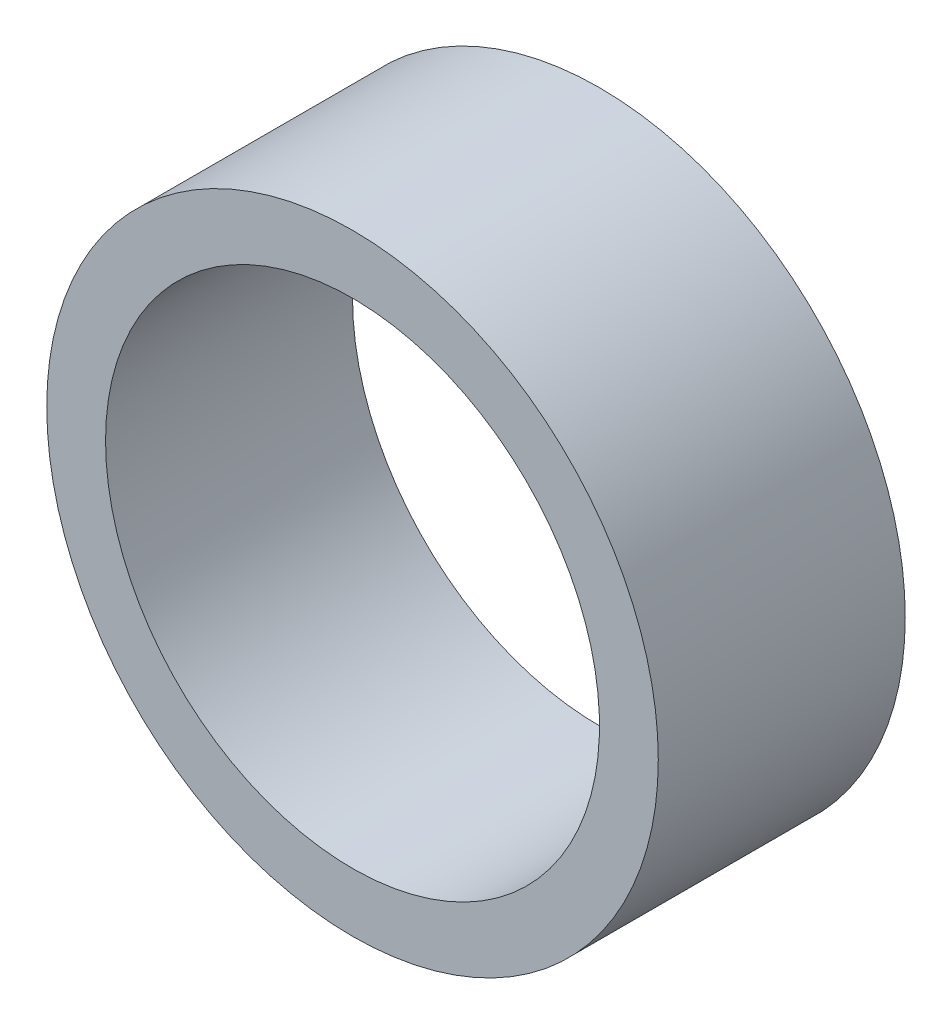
ISO-10303-21;
HEADER;
FILE_DESCRIPTION(('STEP AP214'),'2;1');
FILE_NAME('part.step','',(''),(''),'','','');
FILE_SCHEMA(('AUTOMOTIVE_DESIGN { 1 0 10303 214 1 1 1 1 }'));
ENDSEC;
DATA;
#1=APPLICATION_CONTEXT('core data for automotive mechanical design processes');
#2=APPLICATION_PROTOCOL_DEFINITION('international standard','automotive_design',2000,#1);
#3=PRODUCT_CONTEXT('',#1,'mechanical');
#4=PRODUCT('Part','Part','',(#3));
#5=PRODUCT_RELATED_PRODUCT_CATEGORY('part','',(#4));
#6=PRODUCT_DEFINITION_FORMATION('','',#4);
#7=PRODUCT_DEFINITION_CONTEXT('part definition',#1,'design');
#8=PRODUCT_DEFINITION('design','',#6,#7);
#9=PRODUCT_DEFINITION_SHAPE('','',#8);
#10=(LENGTH_UNIT() NAMED_UNIT(*) SI_UNIT(.MILLI.,.METRE.));
#11=(NAMED_UNIT(*) PLANE_ANGLE_UNIT() SI_UNIT($,.RADIAN.));
#12=(NAMED_UNIT(*) SI_UNIT($,.STERADIAN.) SOLID_ANGLE_UNIT());
#13=UNCERTAINTY_MEASURE_WITH_UNIT(LENGTH_MEASURE(1.E-05),#10,'distance_accuracy_value','');
#14=(GEOMETRIC_REPRESENTATION_CONTEXT(3) GLOBAL_UNCERTAINTY_ASSIGNED_CONTEXT((#13)) GLOBAL_UNIT_ASSIGNED_CONTEXT((#10,
#11,#12)) REPRESENTATION_CONTEXT('',''));
#15=CARTESIAN_POINT('',(0.,0.,0.));
#16=DIRECTION('',(0.,0.,1.));
#17=DIRECTION('',(1.,0.,0.));
#18=AXIS2_PLACEMENT_3D('',#15,#16,#17);
#19=CARTESIAN_POINT('',(0.,0.,21.));
#20=DIRECTION('',(0.,0.,1.));
#21=DIRECTION('',(1.,0.,0.));
#22=AXIS2_PLACEMENT_3D('',#19,#20,#21);
#23=PLANE('',#22);
#24=CARTESIAN_POINT('',(0.,0.,21.));
#25=DIRECTION('',(0.,0.,1.));
#26=DIRECTION('',(1.,0.,0.));
#27=AXIS2_PLACEMENT_3D('',#24,#25,#26);
#28=CIRCLE('',#27,26.);
#29=CARTESIAN_POINT('',(-26.,0.,21.));
#30=VERTEX_POINT('',#29);
#31=EDGE_CURVE('E10',#30,#30,#28,.T.);
#32=ORIENTED_EDGE('',*,*,#31,.T.);
#33=EDGE_LOOP('',(#32));
#34=FACE_BOUND('',#33,.T.);
#35=CARTESIAN_POINT('',(0.,0.,21.));
#36=DIRECTION('',(0.,0.,1.));
#37=DIRECTION('',(1.,0.,0.));
#38=AXIS2_PLACEMENT_3D('',#35,#36,#37);
#39=CIRCLE('',#38,21.);
#40=CARTESIAN_POINT('',(-21.,0.,21.));
#41=VERTEX_POINT('',#40);
#42=EDGE_CURVE('E41',#41,#41,#39,.T.);
#43=ORIENTED_EDGE('',*,*,#42,.F.);
#44=EDGE_LOOP('',(#43));
#45=FACE_BOUND('',#44,.T.);
#46=ADVANCED_FACE('F30',(#34,#45),#23,.T.);
#47=CARTESIAN_POINT('',(0.,0.,0.));
#48=DIRECTION('',(0.,0.,1.));
#49=DIRECTION('',(1.,0.,0.));
#50=AXIS2_PLACEMENT_3D('',#47,#48,#49);
#51=PLANE('',#50);
#52=CARTESIAN_POINT('',(0.,0.,0.));
#53=DIRECTION('',(0.,0.,1.));
#54=DIRECTION('',(1.,0.,0.));
#55=AXIS2_PLACEMENT_3D('',#52,#53,#54);
#56=CIRCLE('',#55,26.);
#57=CARTESIAN_POINT('',(-26.,0.,0.));
#58=VERTEX_POINT('',#57);
#59=EDGE_CURVE('E34',#58,#58,#56,.T.);
#60=ORIENTED_EDGE('',*,*,#59,.F.);
#61=EDGE_LOOP('',(#60));
#62=FACE_BOUND('',#61,.T.);
#63=CARTESIAN_POINT('',(0.,0.,0.));
#64=DIRECTION('',(0.,0.,1.));
#65=DIRECTION('',(1.,0.,0.));
#66=AXIS2_PLACEMENT_3D('',#63,#64,#65);
#67=CIRCLE('',#66,21.);
#68=CARTESIAN_POINT('',(-21.,0.,0.));
#69=VERTEX_POINT('',#68);
#70=EDGE_CURVE('E43',#69,#69,#67,.T.);
#71=ORIENTED_EDGE('',*,*,#70,.T.);
#72=EDGE_LOOP('',(#71));
#73=FACE_BOUND('',#72,.T.);
#74=ADVANCED_FACE('F53',(#62,#73),#51,.F.);
#75=CARTESIAN_POINT('',(0.,0.,21.));
#76=DIRECTION('',(0.,0.,-1.));
#77=DIRECTION('',(-1.,0.,0.));
#78=AXIS2_PLACEMENT_3D('',#75,#76,#77);
#79=CYLINDRICAL_SURFACE('',#78,26.);
#80=CARTESIAN_POINT('',(-26.,0.,21.));
#81=CARTESIAN_POINT('',(-26.,0.,20.78125));
#82=CARTESIAN_POINT('',(-26.,0.,20.5625));
#83=CARTESIAN_POINT('',(-26.,0.,20.125));
#84=CARTESIAN_POINT('',(-26.,0.,19.90625));
#85=CARTESIAN_POINT('',(-26.,0.,19.46875));
#86=CARTESIAN_POINT('',(-26.,0.,19.25));
#87=CARTESIAN_POINT('',(-26.,0.,18.8125));
#88=CARTESIAN_POINT('',(-26.,0.,18.59375));
#89=CARTESIAN_POINT('',(-26.,0.,18.15625));
#90=CARTESIAN_POINT('',(-26.,0.,17.9375));
#91=CARTESIAN_POINT('',(-26.,0.,17.5));
#92=CARTESIAN_POINT('',(-26.,0.,17.28125));
#93=CARTESIAN_POINT('',(-26.,0.,16.84375));
#94=CARTESIAN_POINT('',(-26.,0.,16.625));
#95=CARTESIAN_POINT('',(-26.,0.,16.1875));
#96=CARTESIAN_POINT('',(-26.,0.,15.96875));
#97=CARTESIAN_POINT('',(-26.,0.,15.53125));
#98=CARTESIAN_POINT('',(-26.,0.,15.3125));
#99=CARTESIAN_POINT('',(-26.,0.,14.875));
#100=CARTESIAN_POINT('',(-26.,0.,14.65625));
#101=CARTESIAN_POINT('',(-26.,0.,14.21875));
#102=CARTESIAN_POINT('',(-26.,0.,14.));
#103=CARTESIAN_POINT('',(-26.,0.,13.5625));
#104=CARTESIAN_POINT('',(-26.,0.,13.34375));
#105=CARTESIAN_POINT('',(-26.,0.,12.90625));
#106=CARTESIAN_POINT('',(-26.,0.,12.6875));
#107=CARTESIAN_POINT('',(-26.,0.,12.25));
#108=CARTESIAN_POINT('',(-26.,0.,12.03125));
#109=CARTESIAN_POINT('',(-26.,0.,11.59375));
#110=CARTESIAN_POINT('',(-26.,0.,11.375));
#111=CARTESIAN_POINT('',(-26.,0.,10.9375));
#112=CARTESIAN_POINT('',(-26.,0.,10.71875));
#113=CARTESIAN_POINT('',(-26.,0.,10.28125));
#114=CARTESIAN_POINT('',(-26.,0.,10.0625));
#115=CARTESIAN_POINT('',(-26.,0.,9.625));
#116=CARTESIAN_POINT('',(-26.,0.,9.40625));
#117=CARTESIAN_POINT('',(-26.,0.,8.96875));
#118=CARTESIAN_POINT('',(-26.,0.,8.75));
#119=CARTESIAN_POINT('',(-26.,0.,8.3125));
#120=CARTESIAN_POINT('',(-26.,0.,8.09375));
#121=CARTESIAN_POINT('',(-26.,0.,7.65625));
#122=CARTESIAN_POINT('',(-26.,0.,7.4375));
#123=CARTESIAN_POINT('',(-26.,0.,7.));
#124=CARTESIAN_POINT('',(-26.,0.,6.78125));
#125=CARTESIAN_POINT('',(-26.,0.,6.34375));
#126=CARTESIAN_POINT('',(-26.,0.,6.125));
#127=CARTESIAN_POINT('',(-26.,0.,5.6875));
#128=CARTESIAN_POINT('',(-26.,0.,5.46875));
#129=CARTESIAN_POINT('',(-26.,0.,5.03125));
#130=CARTESIAN_POINT('',(-26.,0.,4.8125));
#131=CARTESIAN_POINT('',(-26.,0.,4.375));
#132=CARTESIAN_POINT('',(-26.,0.,4.15625));
#133=CARTESIAN_POINT('',(-26.,0.,3.71875));
#134=CARTESIAN_POINT('',(-26.,0.,3.5));
#135=CARTESIAN_POINT('',(-26.,0.,3.0625));
#136=CARTESIAN_POINT('',(-26.,0.,2.84375));
#137=CARTESIAN_POINT('',(-26.,0.,2.40625));
#138=CARTESIAN_POINT('',(-26.,0.,2.1875));
#139=CARTESIAN_POINT('',(-26.,0.,1.75));
#140=CARTESIAN_POINT('',(-26.,0.,1.53125));
#141=CARTESIAN_POINT('',(-26.,0.,1.09375));
#142=CARTESIAN_POINT('',(-26.,0.,0.875000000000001));
#143=CARTESIAN_POINT('',(-26.,0.,0.4375));
#144=CARTESIAN_POINT('',(-26.,0.,0.21875));
#145=CARTESIAN_POINT('',(-26.,0.,0.));
#146=B_SPLINE_CURVE_WITH_KNOTS('',3,(#80,#81,#82,#83,#84,#85,#86,#87,#88,#89,#90,#91,#92,#93,
#94,#95,#96,#97,#98,#99,#100,#101,#102,#103,#104,#105,#106,#107,#108,#109,#110,#111,#112,#113,
#114,#115,#116,#117,#118,#119,#120,#121,#122,#123,#124,#125,#126,#127,#128,#129,#130,#131,#132,
#133,#134,#135,#136,#137,#138,#139,#140,#141,#142,#143,#144,#145),.UNSPECIFIED.,.F.,.F.,(4,2,2,
2,2,2,2,2,2,2,2,2,2,2,2,2,2,2,2,2,2,2,2,2,2,2,2,2,2,2,2,2,4),(0.,0.656249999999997,1.3125,
1.96875,2.625,3.28125,3.9375,4.59375,5.25,5.90625,6.5625,7.21875,7.875,8.53125,9.1875,9.84375,
10.5,11.15625,11.8125,12.46875,13.125,13.78125,14.4375,15.09375,15.75,16.40625,17.0625,17.71875,
18.375,19.03125,19.6875,20.34375,21.),.UNSPECIFIED.);
#147=EDGE_CURVE('BSEAM32',#30,#58,#146,.T.);
#148=ORIENTED_EDGE('',*,*,#31,.F.);
#149=ORIENTED_EDGE('',*,*,#59,.T.);
#150=ORIENTED_EDGE('',*,*,#147,.T.);
#151=ORIENTED_EDGE('',*,*,#147,.F.);
#152=EDGE_LOOP('',(#148,#150,#149,#151));
#153=FACE_BOUND('',#152,.T.);
#154=ADVANCED_FACE('F32',(#153),#79,.T.);
#155=CARTESIAN_POINT('',(0.,0.,21.));
#156=DIRECTION('',(0.,0.,-1.));
#157=DIRECTION('',(-1.,0.,0.));
#158=AXIS2_PLACEMENT_3D('',#155,#156,#157);
#159=CYLINDRICAL_SURFACE('',#158,21.);
#160=CARTESIAN_POINT('',(-21.,0.,21.));
#161=CARTESIAN_POINT('',(-21.,0.,20.78125));
#162=CARTESIAN_POINT('',(-21.,0.,20.5625));
#163=CARTESIAN_POINT('',(-21.,0.,20.125));
#164=CARTESIAN_POINT('',(-21.,0.,19.90625));
#165=CARTESIAN_POINT('',(-21.,0.,19.46875));
#166=CARTESIAN_POINT('',(-21.,0.,19.25));
#167=CARTESIAN_POINT('',(-21.,0.,18.8125));
#168=CARTESIAN_POINT('',(-21.,0.,18.59375));
#169=CARTESIAN_POINT('',(-21.,0.,18.15625));
#170=CARTESIAN_POINT('',(-21.,0.,17.9375));
#171=CARTESIAN_POINT('',(-21.,0.,17.5));
#172=CARTESIAN_POINT('',(-21.,0.,17.28125));
#173=CARTESIAN_POINT('',(-21.,0.,16.84375));
#174=CARTESIAN_POINT('',(-21.,0.,16.625));
#175=CARTESIAN_POINT('',(-21.,0.,16.1875));
#176=CARTESIAN_POINT('',(-21.,0.,15.96875));
#177=CARTESIAN_POINT('',(-21.,0.,15.53125));
#178=CARTESIAN_POINT('',(-21.,0.,15.3125));
#179=CARTESIAN_POINT('',(-21.,0.,14.875));
#180=CARTESIAN_POINT('',(-21.,0.,14.65625));
#181=CARTESIAN_POINT('',(-21.,0.,14.21875));
#182=CARTESIAN_POINT('',(-21.,0.,14.));
#183=CARTESIAN_POINT('',(-21.,0.,13.5625));
#184=CARTESIAN_POINT('',(-21.,0.,13.34375));
#185=CARTESIAN_POINT('',(-21.,0.,12.90625));
#186=CARTESIAN_POINT('',(-21.,0.,12.6875));
#187=CARTESIAN_POINT('',(-21.,0.,12.25));
#188=CARTESIAN_POINT('',(-21.,0.,12.03125));
#189=CARTESIAN_POINT('',(-21.,0.,11.59375));
#190=CARTESIAN_POINT('',(-21.,0.,11.375));
#191=CARTESIAN_POINT('',(-21.,0.,10.9375));
#192=CARTESIAN_POINT('',(-21.,0.,10.71875));
#193=CARTESIAN_POINT('',(-21.,0.,10.28125));
#194=CARTESIAN_POINT('',(-21.,0.,10.0625));
#195=CARTESIAN_POINT('',(-21.,0.,9.625));
#196=CARTESIAN_POINT('',(-21.,0.,9.40625));
#197=CARTESIAN_POINT('',(-21.,0.,8.96875));
#198=CARTESIAN_POINT('',(-21.,0.,8.75));
#199=CARTESIAN_POINT('',(-21.,0.,8.3125));
#200=CARTESIAN_POINT('',(-21.,0.,8.09375));
#201=CARTESIAN_POINT('',(-21.,0.,7.65625));
#202=CARTESIAN_POINT('',(-21.,0.,7.4375));
#203=CARTESIAN_POINT('',(-21.,0.,7.));
#204=CARTESIAN_POINT('',(-21.,0.,6.78125));
#205=CARTESIAN_POINT('',(-21.,0.,6.34375));
#206=CARTESIAN_POINT('',(-21.,0.,6.125));
#207=CARTESIAN_POINT('',(-21.,0.,5.6875));
#208=CARTESIAN_POINT('',(-21.,0.,5.46875));
#209=CARTESIAN_POINT('',(-21.,0.,5.03125));
#210=CARTESIAN_POINT('',(-21.,0.,4.8125));
#211=CARTESIAN_POINT('',(-21.,0.,4.375));
#212=CARTESIAN_POINT('',(-21.,0.,4.15625));
#213=CARTESIAN_POINT('',(-21.,0.,3.71875));
#214=CARTESIAN_POINT('',(-21.,0.,3.5));
#215=CARTESIAN_POINT('',(-21.,0.,3.0625));
#216=CARTESIAN_POINT('',(-21.,0.,2.84375));
#217=CARTESIAN_POINT('',(-21.,0.,2.40625));
#218=CARTESIAN_POINT('',(-21.,0.,2.1875));
#219=CARTESIAN_POINT('',(-21.,0.,1.75));
#220=CARTESIAN_POINT('',(-21.,0.,1.53125));
#221=CARTESIAN_POINT('',(-21.,0.,1.09375));
#222=CARTESIAN_POINT('',(-21.,0.,0.875000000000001));
#223=CARTESIAN_POINT('',(-21.,0.,0.4375));
#224=CARTESIAN_POINT('',(-21.,0.,0.21875));
#225=CARTESIAN_POINT('',(-21.,0.,0.));
#226=B_SPLINE_CURVE_WITH_KNOTS('',3,(#160,#161,#162,#163,#164,#165,#166,#167,#168,#169,#170,
#171,#172,#173,#174,#175,#176,#177,#178,#179,#180,#181,#182,#183,#184,#185,#186,#187,#188,#189,
#190,#191,#192,#193,#194,#195,#196,#197,#198,#199,#200,#201,#202,#203,#204,#205,#206,#207,#208,
#209,#210,#211,#212,#213,#214,#215,#216,#217,#218,#219,#220,#221,#222,#223,#224,#225),
.UNSPECIFIED.,.F.,.F.,(4,2,2,2,2,2,2,2,2,2,2,2,2,2,2,2,2,2,2,2,2,2,2,2,2,2,2,2,2,2,2,2,4),(0.,
0.656250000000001,1.3125,1.96875,2.625,3.28125,3.9375,4.59375,5.25,5.90625,6.5625,7.21875,7.875,
8.53125,9.1875,9.84375,10.5,11.15625,11.8125,12.46875,13.125,13.78125,14.4375,15.09375,15.75,
16.40625,17.0625,17.71875,18.375,19.03125,19.6875,20.34375,21.),.UNSPECIFIED.);
#227=EDGE_CURVE('BSEAM49',#41,#69,#226,.T.);
#228=ORIENTED_EDGE('',*,*,#42,.T.);
#229=ORIENTED_EDGE('',*,*,#70,.F.);
#230=ORIENTED_EDGE('',*,*,#227,.T.);
#231=ORIENTED_EDGE('',*,*,#227,.F.);
#232=EDGE_LOOP('',(#228,#230,#229,#231));
#233=FACE_BOUND('',#232,.T.);
#234=ADVANCED_FACE('F49',(#233),#159,.F.);
#235=CLOSED_SHELL('',(#46,#74,#154,#234));
#236=MANIFOLD_SOLID_BREP('B2',#235);
#237=ADVANCED_BREP_SHAPE_REPRESENTATION('',(#18,#236),#14);
#238=SHAPE_DEFINITION_REPRESENTATION(#9,#237);
ENDSEC;
END-ISO-10303-21;
